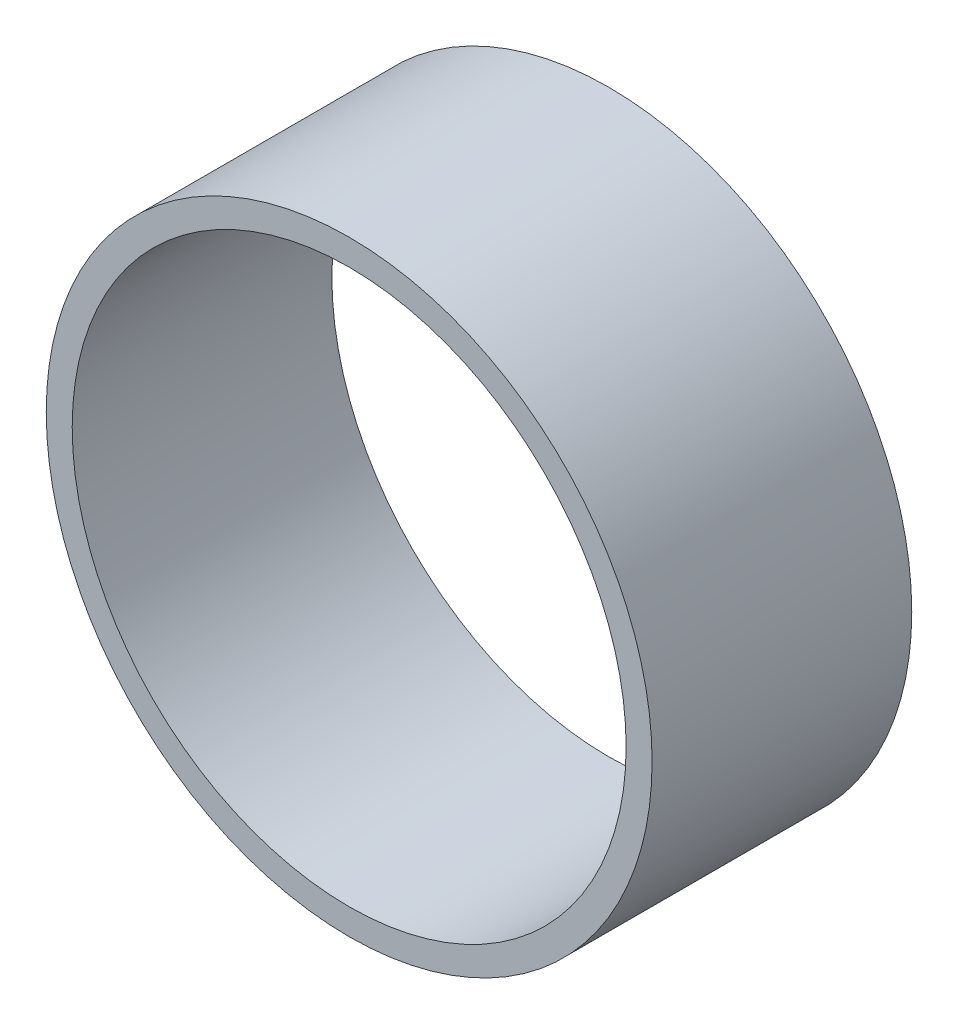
from build123d import *

# Parameters (mm, degrees)
SKETCH1_R      = 35
SKETCH1_R_2    = 32
EXTRUDE1_DEPTH = 30


with BuildPart() as part:
    # Sketch1 → Extrude1 (new body)
    with BuildSketch(Plane.XY):
        Circle(SKETCH1_R)
        Circle(SKETCH1_R_2, mode=Mode.SUBTRACT)
    extrude(amount=EXTRUDE1_DEPTH)


solid = part.part
